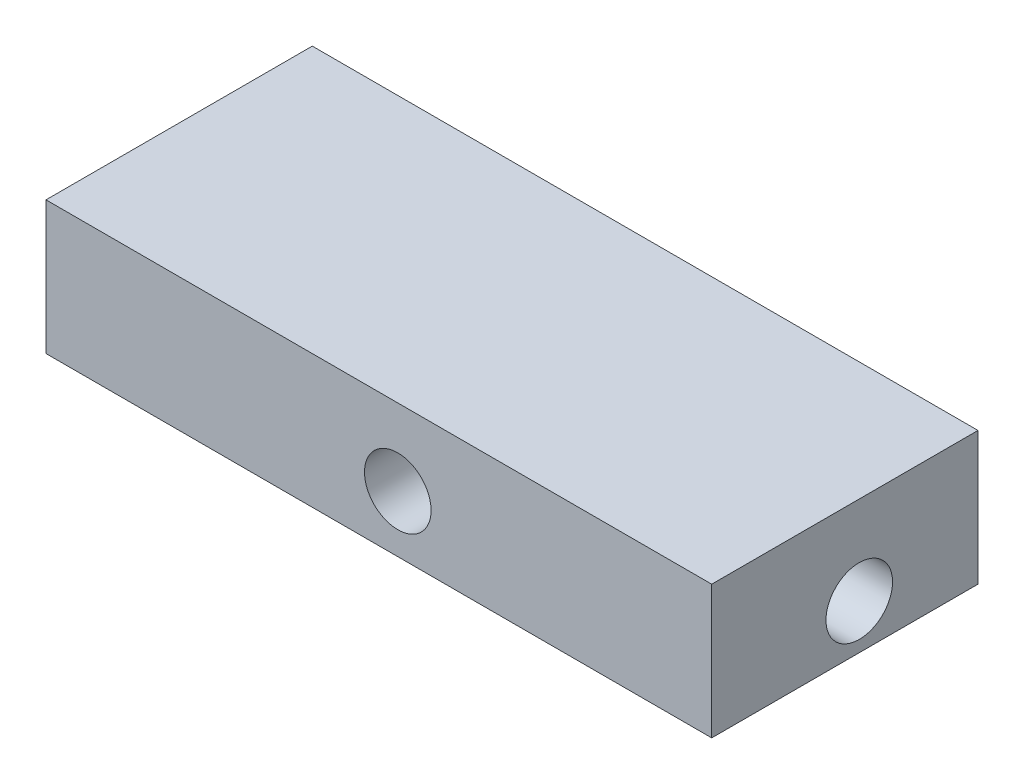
ISO-10303-21;
HEADER;
FILE_DESCRIPTION(('STEP AP214'),'2;1');
FILE_NAME('part.step','',(''),(''),'','','');
FILE_SCHEMA(('AUTOMOTIVE_DESIGN { 1 0 10303 214 1 1 1 1 }'));
ENDSEC;
DATA;
#1=APPLICATION_CONTEXT('core data for automotive mechanical design processes');
#2=APPLICATION_PROTOCOL_DEFINITION('international standard','automotive_design',2000,#1);
#3=PRODUCT_CONTEXT('',#1,'mechanical');
#4=PRODUCT('Part','Part','',(#3));
#5=PRODUCT_RELATED_PRODUCT_CATEGORY('part','',(#4));
#6=PRODUCT_DEFINITION_FORMATION('','',#4);
#7=PRODUCT_DEFINITION_CONTEXT('part definition',#1,'design');
#8=PRODUCT_DEFINITION('design','',#6,#7);
#9=PRODUCT_DEFINITION_SHAPE('','',#8);
#10=(LENGTH_UNIT() NAMED_UNIT(*) SI_UNIT(.MILLI.,.METRE.));
#11=(NAMED_UNIT(*) PLANE_ANGLE_UNIT() SI_UNIT($,.RADIAN.));
#12=(NAMED_UNIT(*) SI_UNIT($,.STERADIAN.) SOLID_ANGLE_UNIT());
#13=UNCERTAINTY_MEASURE_WITH_UNIT(LENGTH_MEASURE(1.E-05),#10,'distance_accuracy_value','');
#14=(GEOMETRIC_REPRESENTATION_CONTEXT(3) GLOBAL_UNCERTAINTY_ASSIGNED_CONTEXT((#13)) GLOBAL_UNIT_ASSIGNED_CONTEXT((#10,
#11,#12)) REPRESENTATION_CONTEXT('',''));
#15=CARTESIAN_POINT('',(0.,0.,0.));
#16=DIRECTION('',(0.,0.,1.));
#17=DIRECTION('',(1.,0.,0.));
#18=AXIS2_PLACEMENT_3D('',#15,#16,#17);
#19=CARTESIAN_POINT('',(0.,0.,-40.));
#20=DIRECTION('',(-1.,0.,0.));
#21=DIRECTION('',(0.,0.,1.));
#22=AXIS2_PLACEMENT_3D('',#19,#20,#21);
#23=PLANE('',#22);
#24=CARTESIAN_POINT('',(0.,8.71793486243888,-18.1606343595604));
#25=DIRECTION('',(-1.,0.,0.));
#26=DIRECTION('',(0.,0.,1.));
#27=AXIS2_PLACEMENT_3D('',#24,#25,#26);
#28=CIRCLE('',#27,5.);
#29=CARTESIAN_POINT('',(0.,8.71793486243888,-13.1606343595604));
#30=VERTEX_POINT('',#29);
#31=EDGE_CURVE('E745',#30,#30,#28,.T.);
#32=ORIENTED_EDGE('',*,*,#31,.F.);
#33=EDGE_LOOP('',(#32));
#34=FACE_BOUND('',#33,.T.);
#35=DIRECTION('',(0.,-1.,0.));
#36=VECTOR('',#35,1.);
#37=CARTESIAN_POINT('',(0.,0.,0.));
#38=LINE('',#37,#36);
#39=CARTESIAN_POINT('',(0.,20.,0.));
#40=VERTEX_POINT('',#39);
#41=CARTESIAN_POINT('',(0.,0.,0.));
#42=VERTEX_POINT('',#41);
#43=EDGE_CURVE('E685',#40,#42,#38,.T.);
#44=ORIENTED_EDGE('',*,*,#43,.F.);
#45=DIRECTION('',(0.,0.,1.));
#46=VECTOR('',#45,1.);
#47=CARTESIAN_POINT('',(0.,20.,-40.));
#48=LINE('',#47,#46);
#49=CARTESIAN_POINT('',(0.,20.,-40.));
#50=VERTEX_POINT('',#49);
#51=EDGE_CURVE('E11',#50,#40,#48,.T.);
#52=ORIENTED_EDGE('',*,*,#51,.F.);
#53=DIRECTION('',(0.,-1.,0.));
#54=VECTOR('',#53,1.);
#55=CARTESIAN_POINT('',(0.,0.,-40.));
#56=LINE('',#55,#54);
#57=CARTESIAN_POINT('',(0.,0.,-40.));
#58=VERTEX_POINT('',#57);
#59=EDGE_CURVE('E687',#50,#58,#56,.T.);
#60=ORIENTED_EDGE('',*,*,#59,.T.);
#61=DIRECTION('',(0.,0.,1.));
#62=VECTOR('',#61,1.);
#63=CARTESIAN_POINT('',(0.,0.,-40.));
#64=LINE('',#63,#62);
#65=EDGE_CURVE('E648',#58,#42,#64,.T.);
#66=ORIENTED_EDGE('',*,*,#65,.T.);
#67=EDGE_LOOP('',(#44,#52,#60,#66));
#68=FACE_BOUND('',#67,.T.);
#69=ADVANCED_FACE('F645',(#34,#68),#23,.T.);
#70=CARTESIAN_POINT('',(0.,20.,-40.));
#71=DIRECTION('',(0.,1.,0.));
#72=DIRECTION('',(0.,0.,1.));
#73=AXIS2_PLACEMENT_3D('',#70,#71,#72);
#74=PLANE('',#73);
#75=DIRECTION('',(-1.,0.,0.));
#76=VECTOR('',#75,1.);
#77=CARTESIAN_POINT('',(0.,20.,0.));
#78=LINE('',#77,#76);
#79=CARTESIAN_POINT('',(100.,20.,0.));
#80=VERTEX_POINT('',#79);
#81=EDGE_CURVE('E702',#80,#40,#78,.T.);
#82=ORIENTED_EDGE('',*,*,#81,.F.);
#83=DIRECTION('',(0.,0.,1.));
#84=VECTOR('',#83,1.);
#85=CARTESIAN_POINT('',(100.,20.,-40.));
#86=LINE('',#85,#84);
#87=CARTESIAN_POINT('',(100.,20.,-40.));
#88=VERTEX_POINT('',#87);
#89=EDGE_CURVE('E653',#88,#80,#86,.T.);
#90=ORIENTED_EDGE('',*,*,#89,.F.);
#91=DIRECTION('',(-1.,0.,0.));
#92=VECTOR('',#91,1.);
#93=CARTESIAN_POINT('',(0.,20.,-40.));
#94=LINE('',#93,#92);
#95=EDGE_CURVE('E692',#88,#50,#94,.T.);
#96=ORIENTED_EDGE('',*,*,#95,.T.);
#97=ORIENTED_EDGE('',*,*,#51,.T.);
#98=EDGE_LOOP('',(#82,#90,#96,#97));
#99=FACE_BOUND('',#98,.T.);
#100=ADVANCED_FACE('F726',(#99),#74,.T.);
#101=CARTESIAN_POINT('',(100.,0.,-40.));
#102=DIRECTION('',(1.,0.,0.));
#103=DIRECTION('',(0.,0.,-1.));
#104=AXIS2_PLACEMENT_3D('',#101,#102,#103);
#105=PLANE('',#104);
#106=CARTESIAN_POINT('',(100.,6.72774510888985,-22.1616074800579));
#107=DIRECTION('',(1.,0.,0.));
#108=DIRECTION('',(0.,0.,-1.));
#109=AXIS2_PLACEMENT_3D('',#106,#107,#108);
#110=CIRCLE('',#109,5.);
#111=CARTESIAN_POINT('',(100.,6.72774510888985,-27.1616074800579));
#112=VERTEX_POINT('',#111);
#113=EDGE_CURVE('E750',#112,#112,#110,.T.);
#114=ORIENTED_EDGE('',*,*,#113,.F.);
#115=EDGE_LOOP('',(#114));
#116=FACE_BOUND('',#115,.T.);
#117=DIRECTION('',(0.,1.,0.));
#118=VECTOR('',#117,1.);
#119=CARTESIAN_POINT('',(100.,0.,0.));
#120=LINE('',#119,#118);
#121=CARTESIAN_POINT('',(100.,0.,0.));
#122=VERTEX_POINT('',#121);
#123=EDGE_CURVE('E699',#122,#80,#120,.T.);
#124=ORIENTED_EDGE('',*,*,#123,.F.);
#125=DIRECTION('',(0.,0.,1.));
#126=VECTOR('',#125,1.);
#127=CARTESIAN_POINT('',(100.,0.,-40.));
#128=LINE('',#127,#126);
#129=CARTESIAN_POINT('',(100.,0.,-40.));
#130=VERTEX_POINT('',#129);
#131=EDGE_CURVE('E691',#130,#122,#128,.T.);
#132=ORIENTED_EDGE('',*,*,#131,.F.);
#133=DIRECTION('',(0.,1.,0.));
#134=VECTOR('',#133,1.);
#135=CARTESIAN_POINT('',(100.,0.,-40.));
#136=LINE('',#135,#134);
#137=EDGE_CURVE('E719',#130,#88,#136,.T.);
#138=ORIENTED_EDGE('',*,*,#137,.T.);
#139=ORIENTED_EDGE('',*,*,#89,.T.);
#140=EDGE_LOOP('',(#124,#132,#138,#139));
#141=FACE_BOUND('',#140,.T.);
#142=ADVANCED_FACE('F723',(#116,#141),#105,.T.);
#143=CARTESIAN_POINT('',(0.,0.,-40.));
#144=DIRECTION('',(0.,-1.,0.));
#145=DIRECTION('',(0.,0.,-1.));
#146=AXIS2_PLACEMENT_3D('',#143,#144,#145);
#147=PLANE('',#146);
#148=DIRECTION('',(1.,0.,0.));
#149=VECTOR('',#148,1.);
#150=CARTESIAN_POINT('',(0.,0.,0.));
#151=LINE('',#150,#149);
#152=EDGE_CURVE('E694',#42,#122,#151,.T.);
#153=ORIENTED_EDGE('',*,*,#152,.F.);
#154=ORIENTED_EDGE('',*,*,#65,.F.);
#155=DIRECTION('',(1.,0.,0.));
#156=VECTOR('',#155,1.);
#157=CARTESIAN_POINT('',(0.,0.,-40.));
#158=LINE('',#157,#156);
#159=EDGE_CURVE('E717',#58,#130,#158,.T.);
#160=ORIENTED_EDGE('',*,*,#159,.T.);
#161=ORIENTED_EDGE('',*,*,#131,.T.);
#162=EDGE_LOOP('',(#153,#154,#160,#161));
#163=FACE_BOUND('',#162,.T.);
#164=ADVANCED_FACE('F695',(#163),#147,.T.);
#165=CARTESIAN_POINT('',(0.,20.,-40.));
#166=DIRECTION('',(0.,0.,-1.));
#167=DIRECTION('',(-1.,0.,0.));
#168=AXIS2_PLACEMENT_3D('',#165,#166,#167);
#169=PLANE('',#168);
#170=CARTESIAN_POINT('',(52.8436479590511,8.50739596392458,-40.));
#171=DIRECTION('',(0.,0.,1.));
#172=DIRECTION('',(1.,0.,0.));
#173=AXIS2_PLACEMENT_3D('',#170,#171,#172);
#174=CIRCLE('',#173,5.);
#175=CARTESIAN_POINT('',(57.8436479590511,8.50739596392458,-40.));
#176=VERTEX_POINT('',#175);
#177=EDGE_CURVE('E704',#176,#176,#174,.T.);
#178=ORIENTED_EDGE('',*,*,#177,.T.);
#179=EDGE_LOOP('',(#178));
#180=FACE_BOUND('',#179,.T.);
#181=ORIENTED_EDGE('',*,*,#59,.F.);
#182=ORIENTED_EDGE('',*,*,#95,.F.);
#183=ORIENTED_EDGE('',*,*,#137,.F.);
#184=ORIENTED_EDGE('',*,*,#159,.F.);
#185=EDGE_LOOP('',(#181,#182,#183,#184));
#186=FACE_BOUND('',#185,.T.);
#187=ADVANCED_FACE('F728',(#180,#186),#169,.T.);
#188=CARTESIAN_POINT('',(0.,20.,0.));
#189=DIRECTION('',(0.,0.,-1.));
#190=DIRECTION('',(-1.,0.,0.));
#191=AXIS2_PLACEMENT_3D('',#188,#189,#190);
#192=PLANE('',#191);
#193=CARTESIAN_POINT('',(52.8436479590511,8.50739596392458,0.));
#194=DIRECTION('',(0.,0.,1.));
#195=DIRECTION('',(1.,0.,0.));
#196=AXIS2_PLACEMENT_3D('',#193,#194,#195);
#197=CIRCLE('',#196,5.);
#198=CARTESIAN_POINT('',(57.8436479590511,8.50739596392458,0.));
#199=VERTEX_POINT('',#198);
#200=EDGE_CURVE('E709',#199,#199,#197,.T.);
#201=ORIENTED_EDGE('',*,*,#200,.F.);
#202=EDGE_LOOP('',(#201));
#203=FACE_BOUND('',#202,.T.);
#204=ORIENTED_EDGE('',*,*,#43,.T.);
#205=ORIENTED_EDGE('',*,*,#152,.T.);
#206=ORIENTED_EDGE('',*,*,#123,.T.);
#207=ORIENTED_EDGE('',*,*,#81,.T.);
#208=EDGE_LOOP('',(#204,#205,#206,#207));
#209=FACE_BOUND('',#208,.T.);
#210=ADVANCED_FACE('F701',(#203,#209),#192,.F.);
#211=CARTESIAN_POINT('',(52.8436479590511,8.50739596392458,-40.));
#212=DIRECTION('',(0.,0.,1.));
#213=DIRECTION('',(1.,0.,0.));
#214=AXIS2_PLACEMENT_3D('',#211,#212,#213);
#215=CYLINDRICAL_SURFACE('',#214,5.);
#216=ORIENTED_EDGE('',*,*,#177,.F.);
#217=EDGE_LOOP('',(#216));
#218=FACE_BOUND('',#217,.T.);
#219=ORIENTED_EDGE('',*,*,#200,.T.);
#220=EDGE_LOOP('',(#219));
#221=FACE_BOUND('',#220,.T.);
#222=ADVANCED_FACE('F735',(#218,#221),#215,.F.);
#223=CARTESIAN_POINT('',(90.,6.72774510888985,-22.1616074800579));
#224=DIRECTION('',(1.,0.,0.));
#225=DIRECTION('',(0.,0.,-1.));
#226=AXIS2_PLACEMENT_3D('',#223,#224,#225);
#227=CYLINDRICAL_SURFACE('',#226,5.);
#228=CARTESIAN_POINT('',(90.,6.72774510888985,-22.1616074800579));
#229=DIRECTION('',(1.,0.,0.));
#230=DIRECTION('',(0.,0.,-1.));
#231=AXIS2_PLACEMENT_3D('',#228,#229,#230);
#232=CIRCLE('',#231,5.);
#233=CARTESIAN_POINT('',(90.,6.72774510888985,-27.1616074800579));
#234=VERTEX_POINT('',#233);
#235=EDGE_CURVE('E755',#234,#234,#232,.T.);
#236=ORIENTED_EDGE('',*,*,#235,.F.);
#237=EDGE_LOOP('',(#236));
#238=FACE_BOUND('',#237,.T.);
#239=ORIENTED_EDGE('',*,*,#113,.T.);
#240=EDGE_LOOP('',(#239));
#241=FACE_BOUND('',#240,.T.);
#242=ADVANCED_FACE('F761',(#238,#241),#227,.F.);
#243=CARTESIAN_POINT('',(90.,6.72774510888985,-22.1616074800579));
#244=DIRECTION('',(1.,0.,0.));
#245=DIRECTION('',(0.,0.,-1.));
#246=AXIS2_PLACEMENT_3D('',#243,#244,#245);
#247=PLANE('',#246);
#248=ORIENTED_EDGE('',*,*,#235,.T.);
#249=EDGE_LOOP('',(#248));
#250=FACE_BOUND('',#249,.T.);
#251=ADVANCED_FACE('F766',(#250),#247,.T.);
#252=CARTESIAN_POINT('',(10.,8.71793486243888,-18.1606343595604));
#253=DIRECTION('',(-1.,0.,0.));
#254=DIRECTION('',(0.,0.,1.));
#255=AXIS2_PLACEMENT_3D('',#252,#253,#254);
#256=CYLINDRICAL_SURFACE('',#255,5.);
#257=CARTESIAN_POINT('',(10.,8.71793486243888,-18.1606343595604));
#258=DIRECTION('',(-1.,0.,0.));
#259=DIRECTION('',(0.,0.,1.));
#260=AXIS2_PLACEMENT_3D('',#257,#258,#259);
#261=CIRCLE('',#260,5.);
#262=CARTESIAN_POINT('',(10.,8.71793486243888,-13.1606343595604));
#263=VERTEX_POINT('',#262);
#264=EDGE_CURVE('E747',#263,#263,#261,.T.);
#265=ORIENTED_EDGE('',*,*,#264,.F.);
#266=EDGE_LOOP('',(#265));
#267=FACE_BOUND('',#266,.T.);
#268=ORIENTED_EDGE('',*,*,#31,.T.);
#269=EDGE_LOOP('',(#268));
#270=FACE_BOUND('',#269,.T.);
#271=ADVANCED_FACE('F773',(#267,#270),#256,.F.);
#272=CARTESIAN_POINT('',(10.,8.71793486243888,-18.1606343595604));
#273=DIRECTION('',(-1.,0.,0.));
#274=DIRECTION('',(0.,0.,1.));
#275=AXIS2_PLACEMENT_3D('',#272,#273,#274);
#276=PLANE('',#275);
#277=ORIENTED_EDGE('',*,*,#264,.T.);
#278=EDGE_LOOP('',(#277));
#279=FACE_BOUND('',#278,.T.);
#280=ADVANCED_FACE('F777',(#279),#276,.T.);
#281=CLOSED_SHELL('',(#69,#100,#142,#164,#187,#210,#222,#242,#251,#271,#280));
#282=MANIFOLD_SOLID_BREP('B2',#281);
#283=ADVANCED_BREP_SHAPE_REPRESENTATION('',(#18,#282),#14);
#284=SHAPE_DEFINITION_REPRESENTATION(#9,#283);
ENDSEC;
END-ISO-10303-21;
